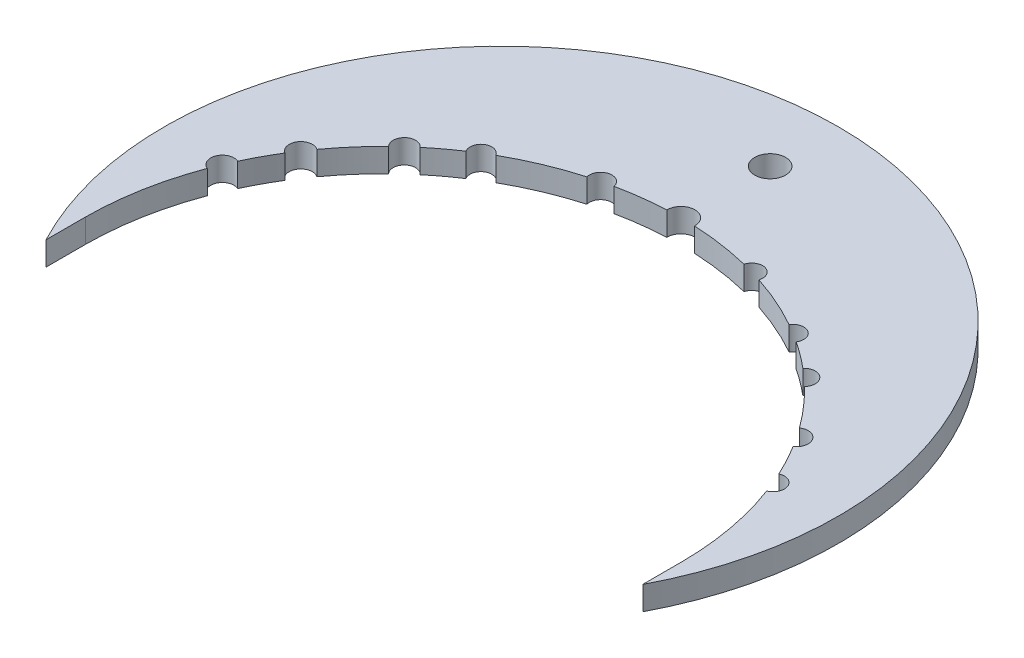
from build123d import *

# Parameters (mm, degrees)
SKETCH1_R           = 3.25
BOSS_EXTRUDE1_DEPTH = 5


with BuildPart() as part:
    # Sketch1 → Boss-Extrude1 (new body)
    with BuildSketch(Plane(origin=(0, 0, 0), x_dir=(1, 0, 0), z_dir=(0, 1, 0))):
        with BuildLine():
            Line((-28.542881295, -8.313061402), (-28.542881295, 0))
            ThreePointArc((-28.542881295, 0), (-27.519538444, 11.019859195), (-24.578784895, 21.689277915))
            ThreePointArc((-24.578784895, 21.689277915), (-25.937675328, 24.91196102), (-22.689121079, 26.20778697))
            ThreePointArc((-22.689121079, 26.20778697), (-21.048406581, 29.484341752), (-19.219494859, 32.659690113))
            ThreePointArc((-19.219494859, 32.659690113), (-19.925698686, 36.062690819), (-16.509658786, 36.702854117))
            ThreePointArc((-16.509658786, 36.702854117), (-13.176236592, 40.894611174), (-9.497994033, 44.787304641))
            ThreePointArc((-9.497994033, 44.787304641), (-9.355624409, 48.143317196), (-6.002866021, 47.938132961))
            ThreePointArc((-6.002866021, 47.938132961), (-3.296433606, 50.076759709), (-0.476727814, 52.063656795))
            ThreePointArc((-0.476727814, 52.063656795), (0.25356392, 55.236325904), (3.4124531, 54.448560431))
            ThreePointArc((3.4124531, 54.448560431), (10.007792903, 57.677757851), (16.934820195, 60.115485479))
            ThreePointArc((16.934820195, 60.115485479), (18.652383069, 63.022105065), (21.526164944, 61.250146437))
            ThreePointArc((21.526164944, 61.250146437), (26.425675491, 62.066503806), (31.374357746, 62.493337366))
            ThreePointArc((31.374357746, 62.493337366), (34.295757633, 65.483472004), (37.217157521, 62.493337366))
            ThreePointArc((37.217157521, 62.493337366), (43.358389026, 61.90434517), (49.412267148, 60.715986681))
            ThreePointArc((49.412267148, 60.715986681), (52.271116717, 62.33386505), (53.836364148, 59.445863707))
            ThreePointArc((53.836364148, 59.445863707), (59.631226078, 57.227557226), (65.179062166, 54.448560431))
            ThreePointArc((65.179062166, 54.448560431), (68.337951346, 55.236325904), (69.06824308, 52.063656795))
            ThreePointArc((69.06824308, 52.063656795), (71.887948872, 50.076759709), (74.594381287, 47.938132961))
            ThreePointArc((74.594381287, 47.938132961), (77.947139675, 48.143317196), (78.089509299, 44.787304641))
            ThreePointArc((78.089509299, 44.787304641), (81.767751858, 40.894611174), (85.101174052, 36.702854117))
            ThreePointArc((85.101174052, 36.702854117), (88.517213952, 36.062690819), (87.811010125, 32.659690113))
            ThreePointArc((87.811010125, 32.659690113), (89.655339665, 29.455653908), (91.308059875, 26.148704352))
            ThreePointArc((91.308059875, 26.148704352), (94.469108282, 24.886834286), (93.147498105, 21.750293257))
            ThreePointArc((93.147498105, 21.750293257), (96.105189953, 11.051895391), (97.134396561, 0))
            Line((97.134396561, 0), (97.134396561, -8.313061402))
            ThreePointArc((97.134396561, -8.313061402), (34.295757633, 95.731751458), (-28.542881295, -8.313061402))
        make_face()
        with Locations(Location((34.295757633, 81.337655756, 0), (0, 0, 270))):
            Circle(SKETCH1_R, mode=Mode.SUBTRACT)
    extrude(amount=BOSS_EXTRUDE1_DEPTH)


solid = part.part
